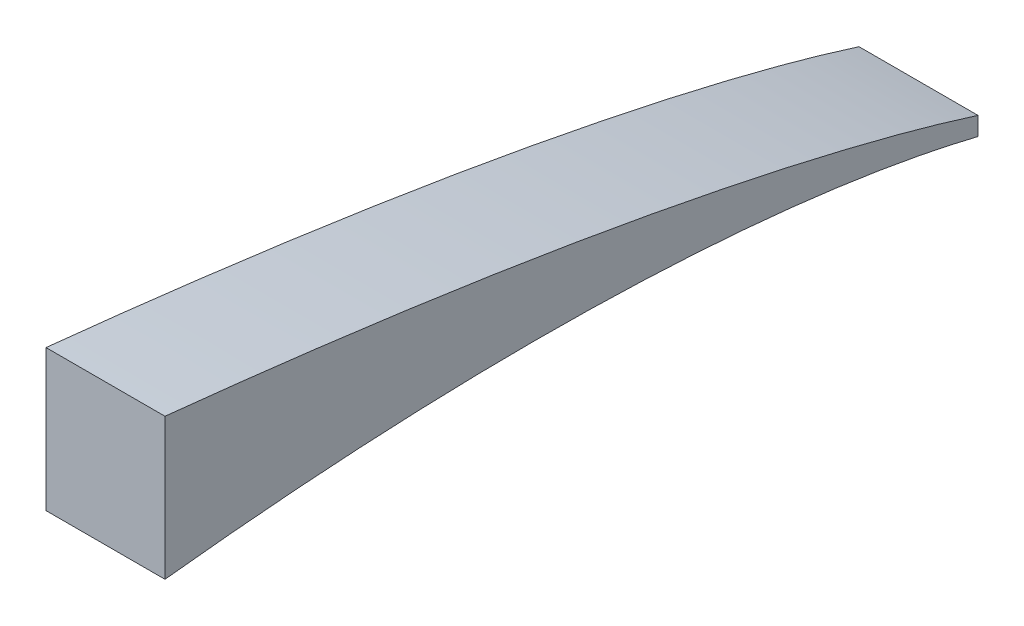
from build123d import *

# Parameters (mm, degrees)
BOSS_EXTRUDE1_DEPTH = 9.525


with BuildPart() as part:
    # Sketch1 → Boss-Extrude1 (new body)
    with BuildSketch(Plane(origin=(0, 0, 0), x_dir=(0, 0, -1), z_dir=(1, 0, 0))):
        with BuildLine():
            Line((68.2625, 18.347143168), (68.2625, 7.040859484))
            add(Edge.make_bspline(
                [(68.2625, 7.040859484), (69.781986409, 7.210393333), (73.625044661, 7.611443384), (79.802913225, 8.133881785), (86.774359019, 8.550290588), (93.686413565, 8.778153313), (100.464089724, 8.804901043), (107.031771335, 8.628583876), (113.314255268, 8.253302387), (119.235995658, 7.683896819), (124.726495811, 6.942169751), (129.386341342, 6.108296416), (132.199931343, 5.478786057), (133.35, 5.195481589)],
                knots=[0.741102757, 0.741102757, 0.741102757, 0.741102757, 0.756094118, 0.778988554, 0.801889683, 0.824566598, 0.846792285, 0.868338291, 0.888978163, 0.908492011, 0.926658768, 0.943286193, 0.95490306, 0.95490306, 0.95490306, 0.95490306], degree=3))
            Line((133.35, 5.195481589), (133.35, 6.663698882))
            add(Edge.make_bspline(
                [(133.35, 6.663698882), (133.02843555, 6.766752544), (131.624319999, 7.209070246), (129.022322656, 7.973635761), (125.436266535, 8.937485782), (121.543710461, 9.898500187), (117.366970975, 10.849724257), (112.930942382, 11.785217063), (108.262713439, 12.700167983), (103.389565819, 13.58332839), (98.342188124, 14.433428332), (93.149666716, 15.239533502), (87.845584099, 16.003202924), (82.463932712, 16.718387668), (77.043692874, 17.382791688), (72.305689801, 17.923740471), (69.378274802, 18.233153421), (68.2625, 18.347143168)],
                knots=[1.047399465, 1.047399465, 1.047399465, 1.047399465, 1.050710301, 1.061833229, 1.07398925, 1.087118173, 1.101145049, 1.115990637, 1.131570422, 1.147788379, 1.164550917, 1.181757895, 1.199311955, 1.217095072, 1.234990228, 1.252856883, 1.263854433, 1.263854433, 1.263854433, 1.263854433], degree=3))
        make_face()
    extrude(amount=BOSS_EXTRUDE1_DEPTH)


solid = part.part
